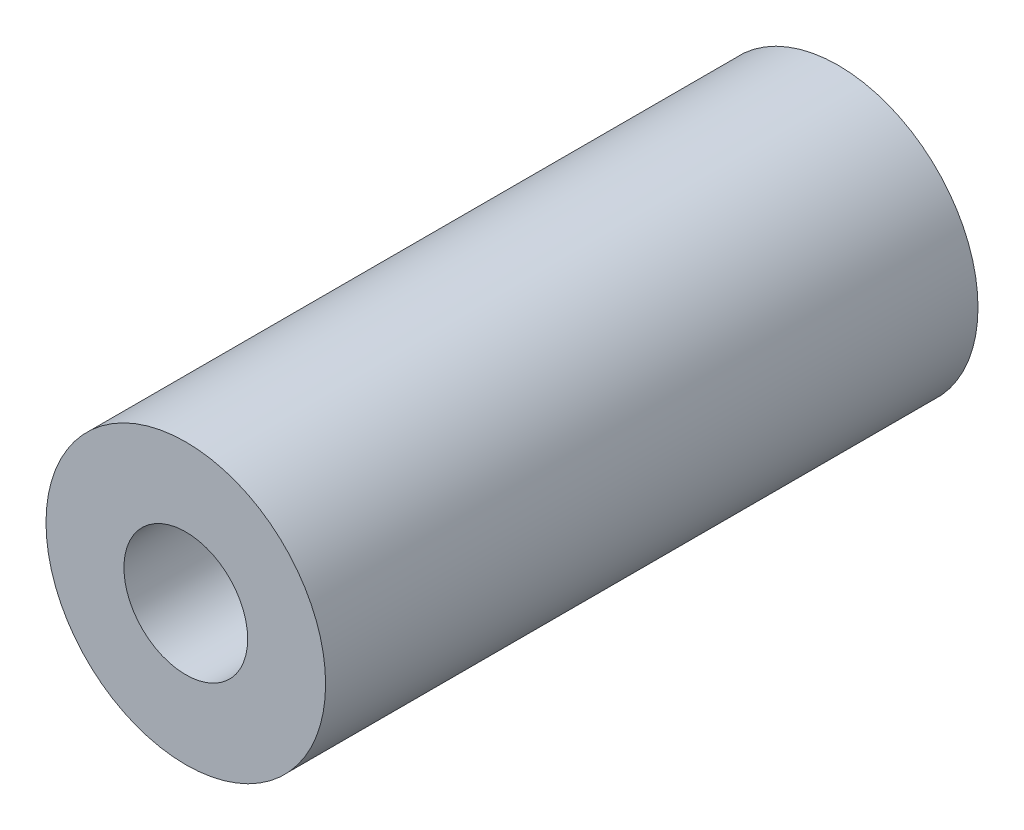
from build123d import *

# Parameters (mm, degrees)
EXTRUDE1_DEPTH      = 11.1125
EXTRUDE1_DEPTH_BACK = 11.1125
SKETCH1_R           = 4.7625
SKETCH1_R_2         = 2.1082


with BuildPart() as part:
    # Sketch1 → Extrude1 (new, two sides: drawn at the far end of the back side and taken through both)
    with BuildSketch(Plane.XY.offset(-EXTRUDE1_DEPTH_BACK)):
        Circle(SKETCH1_R)
        Circle(SKETCH1_R_2, mode=Mode.SUBTRACT)
    extrude(amount=EXTRUDE1_DEPTH + EXTRUDE1_DEPTH_BACK)


solid = part.part
